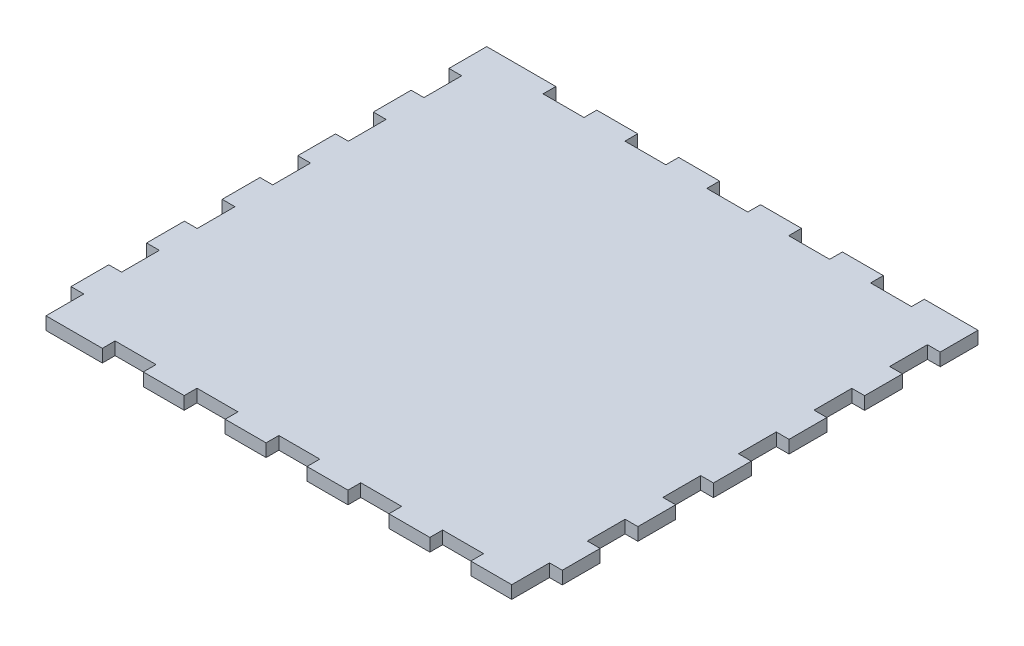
from build123d import *

# Parameters (mm, degrees)
SKETCH1_W           = 130
SKETCH1_H           = 120
BOSS_EXTRUDE1_DEPTH = 3.38
SKETCH4_W           = 3.38
SKETCH4_H           = 10
CUT_EXTRUDE2_DEPTH  = 3.38
SKETCH5_W           = 10.833333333
SKETCH5_H           = 3.38
SKETCH5_W_2         = 10.833333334
CUT_EXTRUDE3_DEPTH  = 3.38


with BuildPart() as part:
    # Sketch1 → Boss-Extrude1 (new body)
    with BuildSketch(Plane(origin=(0, 0, 0), x_dir=(1, 0, 0), z_dir=(0, 1, 0))):
        Rectangle(SKETCH1_W, SKETCH1_H)
    extrude(amount=BOSS_EXTRUDE1_DEPTH)

    # Sketch4 → Cut-Extrude2 (cut)
    with BuildSketch(Plane(origin=(0, 3.38, 0), x_dir=(1, 0, 0), z_dir=(0, 1, 0))):
        with Locations((63.31, 25)):
            Rectangle(SKETCH4_W, SKETCH4_H)
        with Locations((63.31, 45)):
            Rectangle(SKETCH4_W, SKETCH4_H)
        with Locations((63.31, 5)):
            Rectangle(SKETCH4_W, SKETCH4_H)
        with Locations((63.31, -15)):
            Rectangle(SKETCH4_W, SKETCH4_H)
        with Locations((63.31, -55)):
            Rectangle(SKETCH4_W, SKETCH4_H)
        with Locations((63.31, -35)):
            Rectangle(SKETCH4_W, SKETCH4_H)
        with Locations((-63.31, -55)):
            Rectangle(SKETCH4_W, SKETCH4_H)
        with Locations((-63.31, -35)):
            Rectangle(SKETCH4_W, SKETCH4_H)
        with Locations((-63.31, -15)):
            Rectangle(SKETCH4_W, SKETCH4_H)
        with Locations((-63.31, 5)):
            Rectangle(SKETCH4_W, SKETCH4_H)
        with Locations((-63.31, 25)):
            Rectangle(SKETCH4_W, SKETCH4_H)
        with Locations((-63.31, 45)):
            Rectangle(SKETCH4_W, SKETCH4_H)
    extrude(amount=-CUT_EXTRUDE2_DEPTH, mode=Mode.SUBTRACT)

    # Sketch5 → Cut-Extrude3 (cut)
    with BuildSketch(Plane(origin=(0, 3.38, 0), x_dir=(1, 0, 0), z_dir=(0, 1, 0))):
        with Locations((-41.296666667, 58.31)):
            Rectangle(SKETCH5_W, SKETCH5_H)
        with Locations((-19.63, 58.31)):
            Rectangle(SKETCH5_W_2, SKETCH5_H)
        with Locations((2.036666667, 58.31)):
            Rectangle(SKETCH5_W, SKETCH5_H)
        with Locations((23.703333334, 58.31)):
            Rectangle(SKETCH5_W, SKETCH5_H)
        with Locations((45.37, 58.31)):
            Rectangle(SKETCH5_W_2, SKETCH5_H)
        with Locations((45.37, -58.31)):
            Rectangle(SKETCH5_W_2, SKETCH5_H)
        with Locations((23.703333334, -58.31)):
            Rectangle(SKETCH5_W, SKETCH5_H)
        with Locations((2.036666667, -58.31)):
            Rectangle(SKETCH5_W, SKETCH5_H)
        with Locations((-19.63, -58.31)):
            Rectangle(SKETCH5_W_2, SKETCH5_H)
        with Locations((-41.296666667, -58.31)):
            Rectangle(SKETCH5_W, SKETCH5_H)
    extrude(amount=-CUT_EXTRUDE3_DEPTH, mode=Mode.SUBTRACT)


solid = part.part
